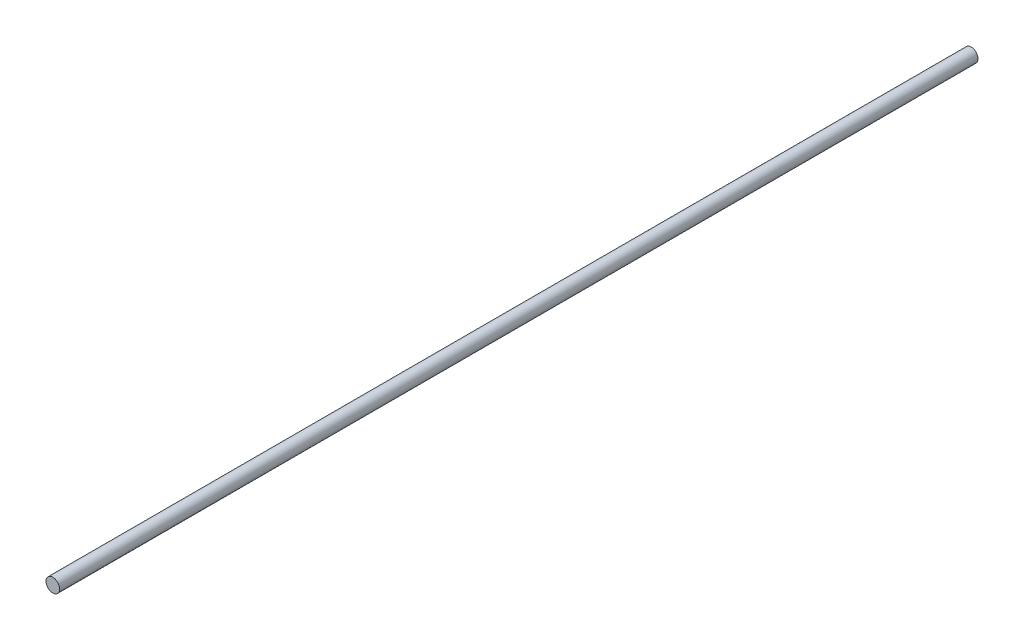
from build123d import *

# Parameters (mm, degrees)
SKETCH1_R           = 30
BOSS_EXTRUDE1_DEPTH = 4050


with BuildPart() as part:
    # Sketch1 → Boss-Extrude1 (new body)
    with BuildSketch(Plane.XY):
        Circle(SKETCH1_R)
    extrude(amount=-BOSS_EXTRUDE1_DEPTH)


solid = part.part
